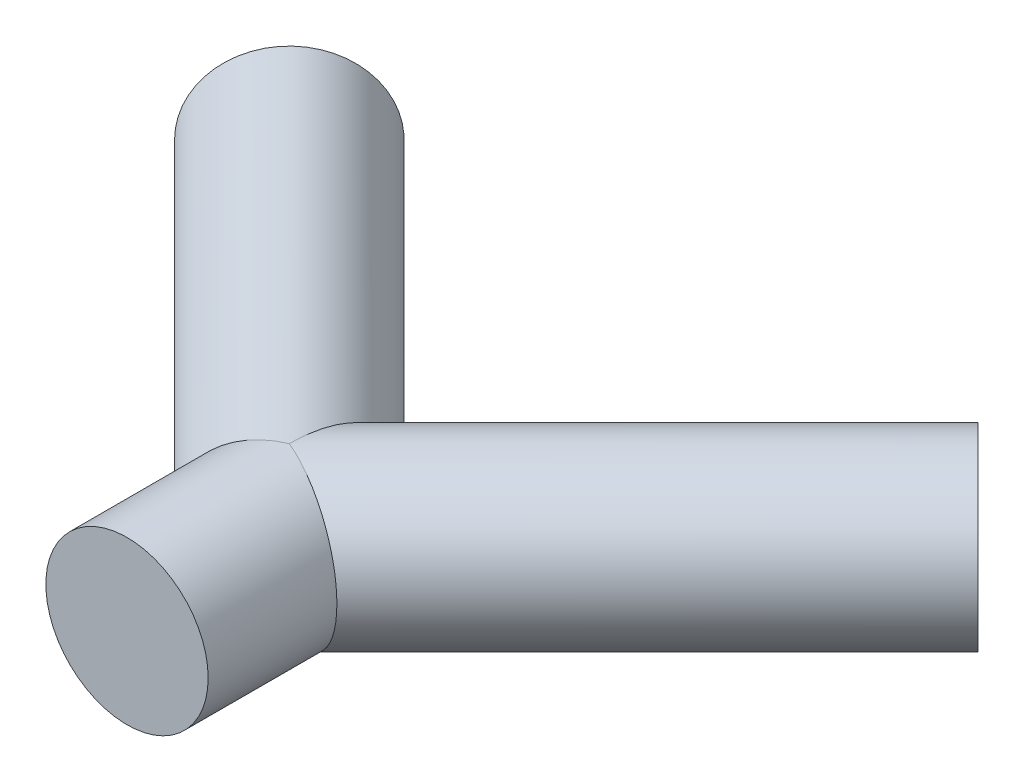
from build123d import *

# Parameters (mm, degrees)
SKETCH2_R          = 6.35
SKETCH4_R          = 6.35
CUT_EXTRUDE1_START = -12.7
SKETCH5_R          = 6.35
CUT_EXTRUDE1_DEPTH = 12.7


with BuildPart() as part:
    # Sweep1: sweep along a path in Sketch1
    with BuildLine(Plane(origin=(0, 0, 0), x_dir=(1, 0, 0), z_dir=(0, 1, 0))) as sweep1_path:
        Line((0, 0), (0, 25.4))
        Line((0, 25.4), (26.940768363, 52.340768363))
    # Sketch2 → Sweep1 (sweep)
    with BuildSketch(Plane.XY):
        Circle(SKETCH2_R)
    sweep(path=sweep1_path.line, transition=Transition.RIGHT)

    # Sweep2: sweep along a path in Sketch3
    with BuildLine(Plane(origin=(0, 0, 0), x_dir=(1, 0, 0), z_dir=(0, 1, 0))) as sweep2_path:
        Line((0, 0), (0, 25.4))
        Line((0, 25.4), (-26.940768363, 52.340768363))
    # Sketch4 → Sweep2 (sweep)
    with BuildSketch(Plane.XY):
        Circle(SKETCH4_R)
    sweep(path=sweep2_path.line, transition=Transition.RIGHT)

    # Sketch5 → Cut-Extrude1 (cut)
    with BuildSketch(Plane.XY.offset(CUT_EXTRUDE1_START)):
        Circle(SKETCH5_R)
    extrude(amount=CUT_EXTRUDE1_DEPTH, mode=Mode.SUBTRACT)


solid = part.part
